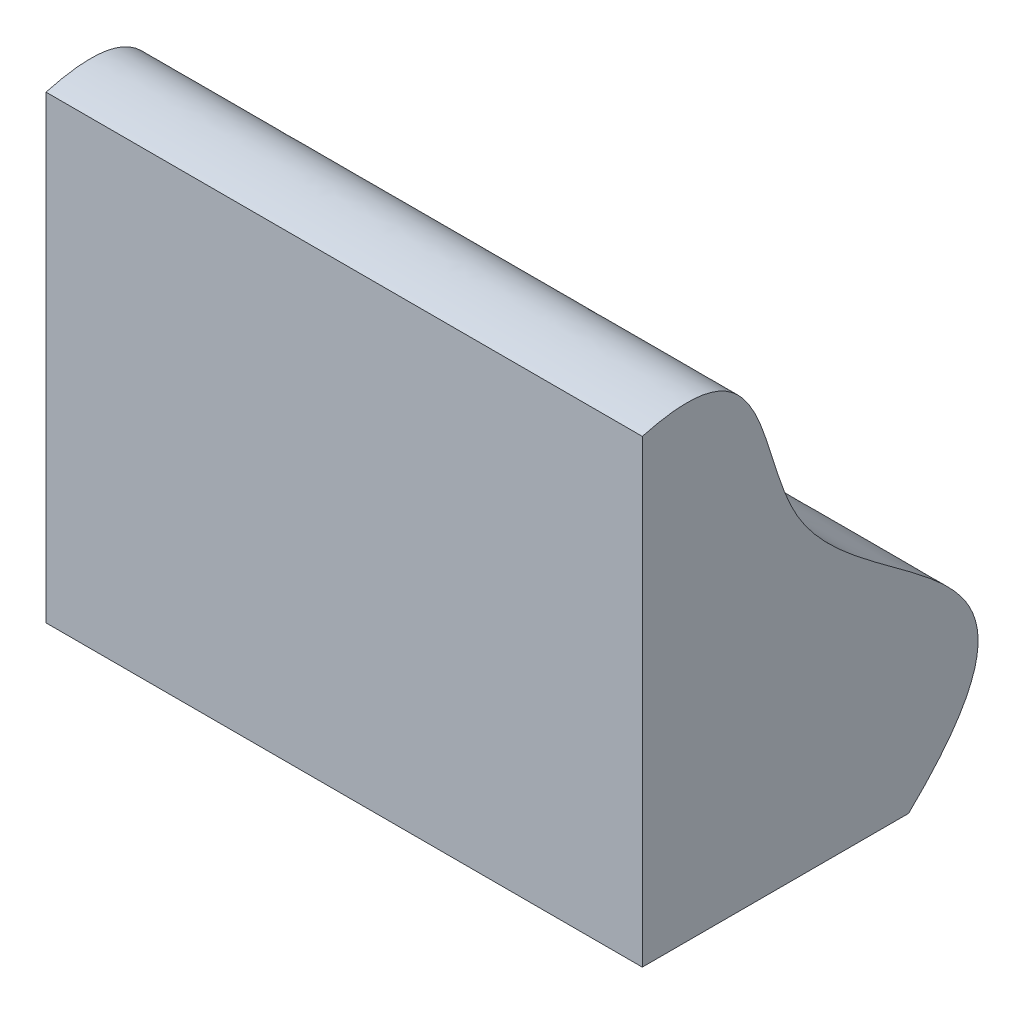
from build123d import *

# Parameters (mm, degrees)
BOSS_EXTRUDE1_DEPTH = 45


with BuildPart() as part:
    # Sketch1 → Boss-Extrude1 (new, symmetric)
    with BuildSketch(Plane(origin=(0, 0, 0), x_dir=(0, 0, -1), z_dir=(1, 0, 0))):
        with BuildLine():
            Line((0, 0), (0, 69.377295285))
            add(Edge.make_bspline(
                [(40.195586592, 0), (67.690916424, 26.411839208), (12.954150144, 31.223200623), (19.619298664, 74.692297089), (0, 69.377295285)],
                knots=[0, 0, 0, 0, 0.623022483, 1, 1, 1, 1], degree=3))
            Line((40.195586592, 0), (0, 0))
        make_face()
    extrude(amount=BOSS_EXTRUDE1_DEPTH, both=True)


solid = part.part
